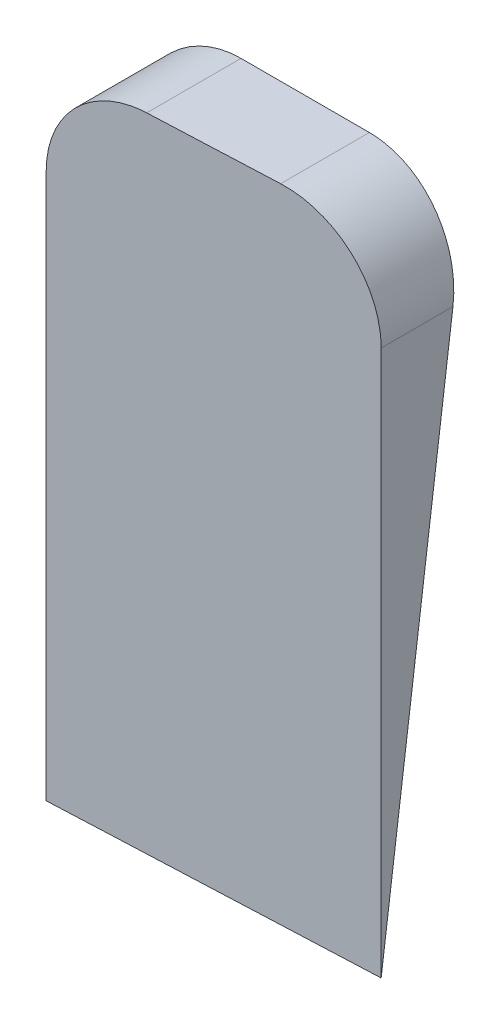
from build123d import *

# Parameters (mm, degrees)
LINEAR_AUSTRAGEN1_DEPTH         = 25
SCHNITT_LINEAR_AUSTRAGEN1_DEPTH = 34.541019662
SCHNITT_LINEAR_AUSTRAGEN2_DEPTH = 34.541019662


with BuildPart() as part:
    # Skizze1 → Linear austragen1 (new body)
    with BuildSketch(Plane.XY):
        with BuildLine():
            Line((0, 0), (10, 0))
            Line((10, 0), (10, 17))
            ThreePointArc((10, 17), (9.121320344, 19.121320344), (7, 20))
            Line((7, 20), (3, 20))
            ThreePointArc((3, 20), (0.878679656, 19.121320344), (0, 17))
            Line((0, 17), (0, 0))
        make_face()
    extrude(amount=LINEAR_AUSTRAGEN1_DEPTH)

    # Skizze2 → Schnitt-Linear austragen1 (cut, through all)
    with BuildSketch(Plane.ZY):
        Polygon((0, 20), (2.633049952, 0), (0, 0), align=None)
    extrude(amount=-SCHNITT_LINEAR_AUSTRAGEN1_DEPTH, mode=Mode.SUBTRACT)

    # Skizze3 → Schnitt-Linear austragen2 (cut, through all)
    with BuildSketch(Plane.XZ):
        Polygon((10, 2.633049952), (10, 25), (0, 25), (0, 3.069659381), align=None)
    extrude(amount=-SCHNITT_LINEAR_AUSTRAGEN2_DEPTH, mode=Mode.SUBTRACT)


solid = part.part
